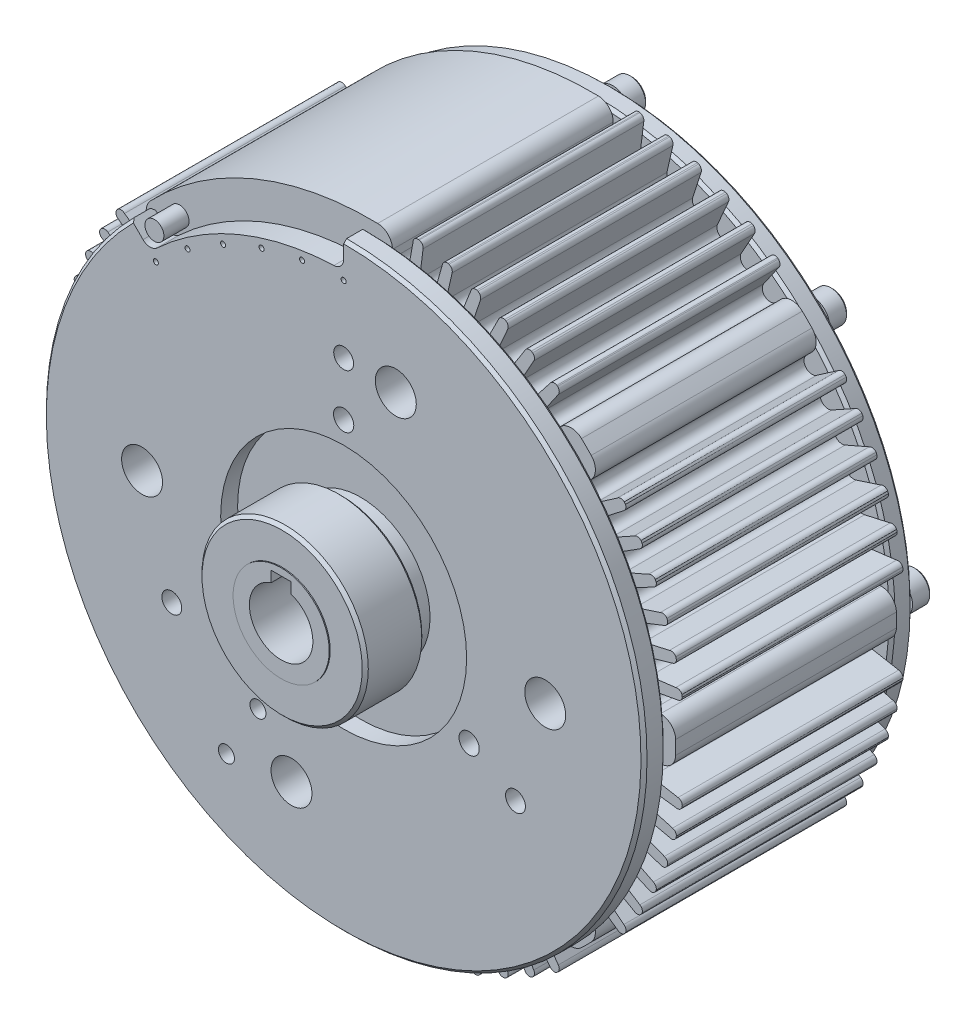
from build123d import *

# Parameters (mm, degrees)
SKETCH2_W                                 = 5.0038
SKETCH2_H                                 = 6.5034
CUT_EXTRUDE1_DEPTH                        = 154.466560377
F_1_4_20_TAPPED_HOLE1_AT_2_COUNT          = 2
F_1_4_20_TAPPED_HOLE1_AT_2_PITCH          = 63.241505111
F_1_4_20_TAPPED_HOLE1_AT_3_COUNT          = 2
F_1_4_20_TAPPED_HOLE1_AT_3_PITCH          = 63.241505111
M6X1_0_TAPPED_HOLE1_AT_2_COUNT            = 2
M6X1_0_TAPPED_HOLE1_AT_2_PITCH            = 86.602367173
M6X1_0_TAPPED_HOLE1_AT_3_COUNT            = 2
M6X1_0_TAPPED_HOLE1_AT_3_PITCH            = 86.602367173
F_13_32_0_40625_DIAMETER_HOLE1_D          = 10.31875
F_13_32_0_40625_DIAMETER_HOLE1_DEPTH      = 9.652
F_13_32_0_40625_DIAMETER_HOLE1_TIP        = 3.100065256
CIRPATTERN1_COUNT                         = 8
F_13_32_0_40625_DIAMETER_HOLE2_AT_2_COUNT = 2
F_13_32_0_40625_DIAMETER_HOLE2_AT_2_PITCH = 80.604699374
CIRPATTERN2_COUNT                         = 2
F_10_32_TAPPED_HOLE1_D                    = 4.0386
F_10_32_TAPPED_HOLE1_DEPTH                = 11.938
F_10_32_TAPPED_HOLE1_TIP                  = 1.213317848
SKETCH14_OUTSIDE_W                        = 210.29
SKETCH14_OUTSIDE_H                        = 210.29
CUT_EXTRUDE2_DEPTH                        = 55.626
CUT_EXTRUDE6_REACH                        = 144.198
SKETCH17_R                                = 0.635
SKETCH18_R                                = 2.3876
BOSS_EXTRUDE1_DEPTH                       = 6.35


with BuildPart() as part:
    # Sketch1 → Revolve1 (revolve)
    with BuildSketch(Plane(origin=(0, 0, 0), x_dir=(0, 0, -1), z_dir=(1, 0, 0)), mode=Mode.PRIVATE) as revolve1_sk:
        with BuildLine():
            Line((-15.754206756, 8), (-15.754206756, 12.108983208))
            Line((-15.754206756, 12.108983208), (-15.506, 12.108983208))
            Line((-15.506, 12.108983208), (-15.506, 20.193))
            Line((-15.506, 20.193), (-14.744, 20.955))
            Line((-14.744, 20.955), (-1.268, 20.955))
            Line((-1.268, 20.955), (-0.506, 20.193))
            Line((-0.506, 20.193), (-0.506, 17.505))
            Line((-0.506, 17.505), (4.2672, 17.505))
            Line((4.2672, 17.505), (4.2672, 30.99181))
            Line((4.2672, 30.99181), (0, 30.99181))
            Line((0, 30.99181), (0, 74.93))
            Line((0, 74.93), (0.762, 75.692))
            Line((0.762, 75.692), (4.826, 75.692))
            Line((4.826, 75.692), (5.588, 74.93))
            Line((5.588, 74.93), (5.588, 66.6115))
            Line((5.588, 66.6115), (6.848, 66.6115))
            Line((6.848, 66.6115), (6.848, 79.375))
            Line((6.848, 79.375), (62.474, 79.375))
            Line((62.474, 79.375), (62.474, 74.93))
            Line((62.474, 74.93), (63.236, 75.692))
            Line((63.236, 75.692), (67.046, 75.692))
            Line((67.046, 75.692), (67.808, 74.93))
            Line((67.808, 74.93), (67.808, 66.548))
            Line((67.808, 66.548), (71.872, 66.548))
            Line((71.872, 66.548), (72.634, 65.786))
            Line((72.634, 65.786), (72.634, 31.0007))
            Line((72.634, 31.0007), (75.652045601, 31.0007))
            Line((75.652045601, 31.0007), (76.463693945, 30.189051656))
            Line((76.463693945, 30.189051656), (76.463693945, 19.347690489))
            ThreePointArc((76.463693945, 19.347690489), (76.639104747, 19.863331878), (76.965370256, 20.299457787))
            Line((76.965370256, 20.299457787), (80.894994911, 24.114894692))
            Line((80.894994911, 24.114894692), (81.864862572, 23.173209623))
            Line((81.864862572, 23.173209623), (81.607463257, 22.098))
            Line((81.607463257, 22.098), (86.866125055, 22.098))
            ThreePointArc((86.866125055, 22.098), (87.93786431, 21.654071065), (88.381793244, 20.582331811))
            Line((88.381793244, 20.582331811), (88.381793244, 14.867163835))
            Line((88.381793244, 14.867163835), (88.893793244, 13.978425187))
            Line((88.893793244, 13.978425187), (88.893793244, 8))
            Line((88.893793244, 8), (-15.754206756, 8))
        make_face()
    revolve(revolve1_sk.sketch.rotate(Axis((0, 0, 38.095236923), (0, 0, -1)), 90), axis=Axis((0, 0, 38.095236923), (0, 0, -1)))

    # Sketch2 → Cut-Extrude1 (cut, through all)
    with BuildSketch(Plane(origin=(0, 0, -88.893793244), x_dir=(-1, 0, 0), z_dir=(0, 0, -1))):
        with Locations((0, 7.0617)):
            Rectangle(SKETCH2_W, SKETCH2_H)
    extrude(amount=-CUT_EXTRUDE1_DEPTH, mode=Mode.SUBTRACT)

    # Sketch3 → 1_4-20 Tapped Hole1 (revolve, cut)
    with BuildSketch(Plane(origin=(-31.620752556, -18.25625, -72.634), x_dir=(0, 1, 0), z_dir=(1, 0, 0))):
        Polygon((0, 0), (0, 12.709816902), (2.5527, 11.176), (2.5527, 0), align=None)
    f_1_4_20_tapped_hole1 = revolve(axis=Axis((-31.620752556, -18.25625, -78.984), (0, 0, 1)), mode=Mode.SUBTRACT)

    # 1_4-20 Tapped Hole1 at 2: 1_4-20 Tapped Hole1 ×2
    with Locations(*[(i * F_1_4_20_TAPPED_HOLE1_AT_2_PITCH, 0, 0) for i in range(1, F_1_4_20_TAPPED_HOLE1_AT_2_COUNT)]):
        add(f_1_4_20_tapped_hole1, mode=Mode.SUBTRACT)

    # 1_4-20 Tapped Hole1 at 3: 1_4-20 Tapped Hole1 ×2
    with Locations(*[Vector(0.49999999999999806, 0.8660254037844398, 0) * (i * F_1_4_20_TAPPED_HOLE1_AT_3_PITCH) for i in range(1, F_1_4_20_TAPPED_HOLE1_AT_3_COUNT)]):
        add(f_1_4_20_tapped_hole1, mode=Mode.SUBTRACT)

    # Sketch5 → M6x1.0 Tapped Hole1 (revolve, cut)
    with BuildSketch(Plane(origin=(0, 49.9999, -72.634), x_dir=(0, 1, 0), z_dir=(1, 0, 0))):
        Polygon((0, 0), (0, 16.488151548), (2.5, 14.986), (2.5, 0), align=None)
    m6x1_0_tapped_hole1 = revolve(axis=Axis((0, 49.9999, -78.984), (0, 0, 1)), mode=Mode.SUBTRACT)

    # M6x1.0 Tapped Hole1 at 2: M6x1.0 Tapped Hole1 ×2
    with Locations(*[Vector(0.49999999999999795, -0.8660254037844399, 0) * (i * M6X1_0_TAPPED_HOLE1_AT_2_PITCH) for i in range(1, M6X1_0_TAPPED_HOLE1_AT_2_COUNT)]):
        add(m6x1_0_tapped_hole1, mode=Mode.SUBTRACT)

    # M6x1.0 Tapped Hole1 at 3: M6x1.0 Tapped Hole1 ×2
    with Locations(*[Vector(-0.49999999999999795, -0.8660254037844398, 0) * (i * M6X1_0_TAPPED_HOLE1_AT_3_PITCH) for i in range(1, M6X1_0_TAPPED_HOLE1_AT_3_COUNT)]):
        add(m6x1_0_tapped_hole1, mode=Mode.SUBTRACT)

    # 13_32 _0.40625_ Diameter Hole1
    with Locations(Plane(origin=(0, 0, -72.634), x_dir=(-1, 0, 0), z_dir=(0, 0, -1))):
        with Locations((50.8, 0), (-50.8, 0)):
            Hole(F_13_32_0_40625_DIAMETER_HOLE1_D / 2, depth=F_13_32_0_40625_DIAMETER_HOLE1_DEPTH)
            with Locations((0, 0, -(F_13_32_0_40625_DIAMETER_HOLE1_DEPTH + F_13_32_0_40625_DIAMETER_HOLE1_TIP / 2))):  # 118° drill point
                Cone(0, F_13_32_0_40625_DIAMETER_HOLE1_D / 2, F_13_32_0_40625_DIAMETER_HOLE1_TIP, mode=Mode.SUBTRACT)

    # Sketch9 → Revolve2 (revolve)
    with BuildSketch(Plane(origin=(0, 0, 0), x_dir=(0, 0, -1), z_dir=(1, 0, 0)), mode=Mode.PRIVATE) as revolve2_sk:
        Polygon((67.808, 75.55865), (72.126, 75.55865), (72.634, 75.05065), (72.634, 71.5899), (67.808, 71.5899), align=None)
    revolve2 = revolve(revolve2_sk.sketch.rotate(Axis((0, 71.5899, -41.060125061), (0, 0, -1)), 90), axis=Axis((0, 71.5899, -41.060125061), (0, 0, -1)))

    # CirPattern1: Revolve2 ×8 about axis
    cirpattern1_axis = Axis((0, 0, 0), (0, 0, 1))
    for i in range(1, CIRPATTERN1_COUNT):
        add(revolve2.rotate(cirpattern1_axis, i * 360 / CIRPATTERN1_COUNT))

    # Mirror1: 1_4-20 Tapped Hole1, M6x1.0 Tapped Hole1 across plane
    add(f_1_4_20_tapped_hole1.mirror(Plane(origin=(0, 0, -36.317), x_dir=(1, 0, 0), z_dir=(0, 0, -1))), mode=Mode.SUBTRACT)
    add(m6x1_0_tapped_hole1.mirror(Plane(origin=(0, 0, -36.317), x_dir=(1, 0, 0), z_dir=(0, 0, -1))), mode=Mode.SUBTRACT)

    # Mirror1 copy 1 sketch → Mirror1 copy 1 (revolve, cut)
    with BuildSketch(Plane(origin=(31.620752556, -18.25625, 0), x_dir=(0, 1, 0), z_dir=(1, 0, 0))):
        Polygon((0, 0), (0, -12.709816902), (2.5527, -11.176), (2.5527, 0), align=None)
    revolve(axis=Axis((31.620752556, -18.25625, 6.35), (0, 0, 1)), mode=Mode.SUBTRACT)

    # Mirror1 copy 2 sketch → Mirror1 copy 2 (revolve, cut)
    with BuildSketch(Plane(origin=(0, 36.5125, 0), x_dir=(0, 1, 0), z_dir=(1, 0, 0))):
        Polygon((0, 0), (0, -12.709816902), (2.5527, -11.176), (2.5527, 0), align=None)
    revolve(axis=Axis((0, 36.5125, 6.35), (0, 0, 1)), mode=Mode.SUBTRACT)

    # Mirror1 copy 3 sketch → Mirror1 copy 3 (revolve, cut)
    with BuildSketch(Plane(origin=(43.301183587, -24.99995, 0), x_dir=(0, 1, 0), z_dir=(1, 0, 0))):
        Polygon((0, 0), (0, -16.488151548), (2.5, -14.986), (2.5, 0), align=None)
    revolve(axis=Axis((43.301183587, -24.99995, 6.35), (0, 0, 1)), mode=Mode.SUBTRACT)

    # Mirror1 copy 4 sketch → Mirror1 copy 4 (revolve, cut)
    with BuildSketch(Plane(origin=(-43.301183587, -24.99995, 0), x_dir=(0, 1, 0), z_dir=(1, 0, 0))):
        Polygon((0, 0), (0, -16.488151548), (2.5, -14.986), (2.5, 0), align=None)
    revolve(axis=Axis((-43.301183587, -24.99995, 6.35), (0, 0, 1)), mode=Mode.SUBTRACT)

    # Sketch10 → 13_32 _0.40625_ Diameter Hole2 (revolve, cut)
    with BuildSketch(Plane(origin=(-50.8, 0, 0), x_dir=(0, -1, 0), z_dir=(1, 0, 0))):
        Polygon((0, 0), (0, 12.752065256), (5.159375, 9.652), (5.159375, 0), align=None)
    f_13_32_0_40625_diameter_hole2 = revolve(axis=Axis((-50.8, 0, 6.35), (0, 0, -1)), mode=Mode.SUBTRACT)

    # 13_32 _0.40625_ Diameter Hole2 at 2: 13_32 _0.40625_ Diameter Hole2 ×2
    with Locations(*[Vector(0.7933533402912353, 0.6087614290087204, 0) * (i * F_13_32_0_40625_DIAMETER_HOLE2_AT_2_PITCH) for i in range(1, F_13_32_0_40625_DIAMETER_HOLE2_AT_2_COUNT)]):
        add(f_13_32_0_40625_diameter_hole2, mode=Mode.SUBTRACT)

    # CirPattern2: 13_32 _0.40625_ Diameter Hole2 ×2 about axis
    cirpattern2_axis = Axis((0, 0, 0), (0, 0, 1))
    for i in range(1, CIRPATTERN2_COUNT):
        add(f_13_32_0_40625_diameter_hole2.rotate(cirpattern2_axis, i * 360 / CIRPATTERN2_COUNT), mode=Mode.SUBTRACT)

    # CirPattern2 copy 1 sketch → CirPattern2 copy 1 (revolve, cut)
    with BuildSketch(Plane(origin=(-13.148007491, -49.069031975, 0), x_dir=(0, 1, 0), z_dir=(-1, 0, 0))):
        Polygon((0, 0), (0, 12.752065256), (5.159375, 9.652), (5.159375, 0), align=None)
    revolve(axis=Axis((-13.148007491, -49.069031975, 6.35), (0, 0, -1)), mode=Mode.SUBTRACT)

    # 10-32 Tapped Hole1
    with Locations(Plane.XY):
        with Locations((-21.59, -37.3888), (-29.5402, -51.1556)):
            Hole(F_10_32_TAPPED_HOLE1_D / 2, depth=F_10_32_TAPPED_HOLE1_DEPTH)
            with Locations((0, 0, -(F_10_32_TAPPED_HOLE1_DEPTH + F_10_32_TAPPED_HOLE1_TIP / 2))):  # 118° drill point
                Cone(0, F_10_32_TAPPED_HOLE1_D / 2, F_10_32_TAPPED_HOLE1_TIP, mode=Mode.SUBTRACT)

    # Sketch14 outside → Cut-Extrude2 (cut)
    with BuildSketch(Plane.XY.offset(-6.848)):
        Rectangle(SKETCH14_OUTSIDE_W, SKETCH14_OUTSIDE_H)
        with BuildLine():
            Line((10.64243444, 77.196331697), (9.453260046, 70.715791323))
            ThreePointArc((9.453260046, 70.715791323), (7.275354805, 68.9015165), (5.461079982, 71.07942174))
            Line((5.461079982, 71.07942174), (5.461079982, 73.009870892))
            ThreePointArc((5.461079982, 73.009870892), (4.375441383, 75.673318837), (1.737219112, 76.818897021))
            ThreePointArc((1.737219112, 76.818897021), (0.868665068, 76.833627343), (0, 76.83853766))
            ThreePointArc((0, 76.83853766), (-30.202937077, 70.653686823), (-55.543713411, 53.094790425))
            ThreePointArc((-55.543713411, 53.094790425), (-56.598420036, 50.418010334), (-55.478838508, 47.767709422))
            Line((-55.478838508, 47.767709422), (-53.924633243, 46.185729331))
            ThreePointArc((-53.924633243, 46.185729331), (-54.082997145, 43.616948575), (-56.644481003, 43.366920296))
            Line((-56.644481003, 43.366920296), (-62.058491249, 47.082630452))
            ThreePointArc((-62.058491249, 47.082630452), (-63.920430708, 47.011508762), (-63.707480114, 45.160420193))
            Line((-63.707480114, 45.160420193), (-58.150806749, 40.835928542))
            ThreePointArc((-58.150806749, 40.835928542), (-57.970497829, 38.240802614), (-60.51575317, 37.703340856))
            Line((-60.51575317, 37.703340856), (-66.285279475, 40.914874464))
            ThreePointArc((-66.285279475, 40.914874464), (-68.131830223, 40.665621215), (-67.742441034, 38.8434651))
            Line((-67.742441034, 38.8434651), (-61.796865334, 35.071466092))
            ThreePointArc((-61.796865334, 35.071466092), (-61.368654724, 32.505569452), (-63.850678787, 31.726630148))
            Line((-63.850678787, 31.726630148), (-69.901455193, 34.370393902))
            ThreePointArc((-69.901455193, 34.370393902), (-71.715614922, 33.945304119), (-71.15337248, 32.16885815))
            Line((-71.15337248, 32.16885815), (-64.873638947, 28.984082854))
            ThreePointArc((-64.873638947, 28.984082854), (-64.201469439, 26.471041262), (-66.597408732, 25.457796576))
            Line((-66.597408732, 25.457796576), (-72.873722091, 27.509447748))
            ThreePointArc((-72.873722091, 27.509447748), (-74.638786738, 26.91243549), (-73.908867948, 25.198056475))
            Line((-73.908867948, 25.198056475), (-67.352797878, 22.629829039))
            ThreePointArc((-67.352797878, 22.629829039), (-66.442858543, 20.192781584), (-68.730652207, 18.954561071))
            Line((-68.730652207, 18.954561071), (-75.174712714, 20.395208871))
            ThreePointArc((-75.174712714, 20.395208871), (-76.874430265, 19.631771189), (-75.983555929, 17.995244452))
            Line((-75.983555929, 17.995244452), (-69.211515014, 16.067212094))
            ThreePointArc((-69.211515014, 16.067212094), (-68.072184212, 13.728598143), (-70.230767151, 12.276802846))
            Line((-70.230767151, 12.276802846), (-76.783240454, 13.093182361))
            ThreePointArc((-76.783240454, 13.093182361), (-78.401960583, 12.170348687), (-77.35833352, 10.626742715))
            Line((-77.35833352, 10.626742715), (-70.690488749, 9.417234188))
            ThreePointArc((-70.690488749, 9.417234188), (-69.07368089, 7.268394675), (-71.062054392, 5.457883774))
            Line((-71.062054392, 5.457883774), (-73.013132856, 5.457883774))
            ThreePointArc((-73.013132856, 5.457883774), (-75.674300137, 4.37317471), (-76.818897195, 1.73721139))
            ThreePointArc((-76.818897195, 1.73721139), (-76.833627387, 0.868661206), (-76.83853766, 0))
            ThreePointArc((-76.83853766, 0), (-76.833627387, -0.868661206), (-76.818897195, -1.73721139))
            ThreePointArc((-76.818897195, -1.73721139), (-75.674300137, -4.37317471), (-73.013132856, -5.457883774))
            Line((-73.013132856, -5.457883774), (-71.062054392, -5.457883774))
            ThreePointArc((-71.062054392, -5.457883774), (-69.039267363, -7.268374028), (-70.690488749, -9.423138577))
            Line((-70.690488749, -9.423138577), (-77.358333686, -10.626023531))
            ThreePointArc((-77.358333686, -10.626023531), (-78.401960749, -12.169629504), (-76.78324062, -13.092463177))
            Line((-76.78324062, -13.092463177), (-70.230767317, -12.276083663))
            ThreePointArc((-70.230767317, -12.276083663), (-68.072184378, -13.72787896), (-69.21151518, -16.066492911))
            Line((-69.21151518, -16.066492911), (-75.983556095, -17.994525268))
            ThreePointArc((-75.983556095, -17.994525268), (-76.874430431, -19.631052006), (-75.17471288, -20.394489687))
            Line((-75.17471288, -20.394489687), (-68.730652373, -18.953841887))
            ThreePointArc((-68.730652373, -18.953841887), (-66.442858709, -20.192062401), (-67.352798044, -22.629109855))
            Line((-67.352798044, -22.629109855), (-73.908868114, -25.197337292))
            ThreePointArc((-73.908868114, -25.197337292), (-74.638786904, -26.911716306), (-72.873722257, -27.508728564))
            Line((-72.873722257, -27.508728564), (-66.597408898, -25.457077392))
            ThreePointArc((-66.597408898, -25.457077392), (-64.201469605, -26.470322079), (-64.873639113, -28.98336367))
            Line((-64.873639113, -28.98336367), (-71.153372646, -32.168138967))
            ThreePointArc((-71.153372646, -32.168138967), (-71.715615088, -33.944584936), (-69.901455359, -34.369674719))
            Line((-69.901455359, -34.369674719), (-63.850678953, -31.725910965))
            ThreePointArc((-63.850678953, -31.725910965), (-61.36865489, -32.504850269), (-61.7968655, -35.070746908))
            Line((-61.7968655, -35.070746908), (-67.7424412, -38.842745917))
            ThreePointArc((-67.7424412, -38.842745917), (-68.131830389, -40.664902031), (-66.285279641, -40.91415528))
            Line((-66.285279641, -40.91415528), (-60.515753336, -37.702621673))
            ThreePointArc((-60.515753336, -37.702621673), (-57.970497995, -38.240083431), (-58.150806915, -40.835209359))
            Line((-58.150806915, -40.835209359), (-63.70748028, -45.159701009))
            ThreePointArc((-63.70748028, -45.159701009), (-63.920430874, -47.010789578), (-62.058491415, -47.081911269))
            Line((-62.058491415, -47.081911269), (-56.644481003, -43.331059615))
            ThreePointArc((-56.644481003, -43.331059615), (-53.976055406, -43.696516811), (-54.0982095, -46.387080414))
            Line((-54.0982095, -46.387080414), (-55.478838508, -47.767709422))
            ThreePointArc((-55.478838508, -47.767709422), (-56.598420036, -50.418010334), (-55.543713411, -53.094790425))
            ThreePointArc((-55.543713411, -53.094790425), (-54.33372791, -54.332374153), (-53.096174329, -55.54239049))
            ThreePointArc((-53.096174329, -55.54239049), (-50.431208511, -56.597828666), (-47.785022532, -55.496151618))
            Line((-47.785022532, -55.496151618), (-46.417914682, -54.129043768))
            ThreePointArc((-46.417914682, -54.129043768), (-43.675735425, -53.975368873), (-43.296849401, -56.695591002))
            Line((-43.296849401, -56.695591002), (-47.176474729, -62.253165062))
            ThreePointArc((-47.176474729, -62.253165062), (-46.822936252, -64.082615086), (-45.025786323, -63.590549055))
            Line((-45.025786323, -63.590549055), (-40.970860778, -58.36285486))
            ThreePointArc((-40.970860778, -58.36285486), (-38.417937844, -57.863080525), (-37.569916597, -60.322358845))
            Line((-37.569916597, -60.322358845), (-40.909667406, -66.47423892))
            ThreePointArc((-40.909667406, -66.47423892), (-40.468158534, -68.179518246), (-38.804941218, -67.599332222))
            Line((-38.804941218, -67.599332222), (-35.266994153, -62.02400151))
            ThreePointArc((-35.266994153, -62.02400151), (-32.695576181, -61.208288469), (-31.545421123, -63.648518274))
            Line((-31.545421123, -63.648518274), (-34.365251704, -70.10037093))
            ThreePointArc((-34.365251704, -70.10037093), (-33.739010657, -71.761338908), (-32.13413357, -71.002812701))
            Line((-32.13413357, -71.002812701), (-29.146846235, -65.114052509))
            ThreePointArc((-29.146846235, -65.114052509), (-26.671056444, -64.074298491), (-25.309248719, -66.388624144))
            Line((-25.309248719, -66.388624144), (-27.497714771, -73.081042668))
            ThreePointArc((-27.497714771, -73.081042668), (-26.698963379, -74.676495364), (-25.172611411, -73.752524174))
            Line((-25.172611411, -73.752524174), (-22.666715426, -67.357592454))
            ThreePointArc((-22.666715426, -67.357592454), (-20.360866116, -66.153329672), (-18.849293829, -68.270483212))
            Line((-18.849293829, -68.270483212), (-20.425888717, -75.388809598))
            ThreePointArc((-20.425888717, -75.388809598), (-19.412769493, -76.952608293), (-17.93081226, -75.823148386))
            Line((-17.93081226, -75.823148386), (-16.122036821, -69.472580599))
            ThreePointArc((-16.122036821, -69.472580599), (-13.942226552, -68.052856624), (-12.234693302, -70.015385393))
            Line((-12.234693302, -70.015385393), (-13.105978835, -77.002423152))
            ThreePointArc((-13.105978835, -77.002423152), (-11.947640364, -78.461919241), (-10.580759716, -77.195619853))
            Line((-10.580759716, -77.195619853), (-9.391585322, -70.715079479))
            ThreePointArc((-9.391585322, -70.715079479), (-7.270029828, -69.211872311), (-5.460917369, -71.079421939))
            Line((-5.460917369, -71.079421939), (-5.460917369, -73.009870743))
            ThreePointArc((-5.460917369, -73.009870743), (-4.375335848, -75.6732619), (-1.737219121, -76.81889702))
            ThreePointArc((-1.737219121, -76.81889702), (-0.868665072, -76.833627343), (0, -76.83853766))
            ThreePointArc((0, -76.83853766), (0.868665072, -76.833627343), (1.737219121, -76.81889702))
            ThreePointArc((1.737219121, -76.81889702), (4.377916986, -75.67079084), (5.461079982, -73.002797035))
            Line((5.461079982, -73.002797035), (5.461079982, -71.079421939))
            ThreePointArc((5.461079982, -71.079421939), (7.274998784, -68.901160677), (9.453260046, -70.715079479))
            Line((9.453260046, -70.715079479), (10.64243444, -77.195619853))
            ThreePointArc((10.64243444, -77.195619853), (12.009315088, -78.461919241), (13.167653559, -77.002423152))
            Line((13.167653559, -77.002423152), (12.296369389, -70.015385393))
            ThreePointArc((12.296369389, -70.015385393), (14.003902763, -68.052856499), (16.183713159, -69.472580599))
            Line((16.183713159, -69.472580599), (17.992487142, -75.823148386))
            ThreePointArc((17.992487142, -75.823148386), (19.47444436, -76.952608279), (20.487563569, -75.388809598))
            Line((20.487563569, -75.388809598), (18.990249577, -68.270483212))
            ThreePointArc((18.990249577, -68.270483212), (20.501821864, -66.153329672), (22.807671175, -67.357592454))
            Line((22.807671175, -67.357592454), (25.177156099, -73.752524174))
            ThreePointArc((25.177156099, -73.752524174), (26.760544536, -74.734744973), (27.619116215, -73.081042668))
            Line((27.619116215, -73.081042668), (25.430650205, -66.388624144))
            ThreePointArc((25.430650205, -66.388624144), (26.732343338, -64.136339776), (29.143000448, -65.114052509))
            Line((29.143000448, -65.114052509), (32.130287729, -71.002812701))
            ThreePointArc((32.130287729, -71.002812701), (33.800528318, -71.82875047), (34.496646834, -70.10037093))
            Line((34.496646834, -70.10037093), (31.676816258, -63.648518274))
            ThreePointArc((31.676816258, -63.648518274), (32.756644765, -61.281841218), (35.2499133, -62.02400151))
            Line((35.2499133, -62.02400151), (38.787860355, -67.599332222))
            ThreePointArc((38.787860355, -67.599332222), (40.529574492, -68.261381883), (41.056829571, -66.47423892))
            Line((41.056829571, -66.47423892), (37.631596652, -60.322358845))
            ThreePointArc((37.631596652, -60.322358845), (38.479617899, -57.863080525), (41.032540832, -58.36285486))
            Line((41.032540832, -58.36285486), (45.089676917, -63.590549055))
            ThreePointArc((45.089676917, -63.590549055), (46.886826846, -64.082615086), (47.240365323, -62.253165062))
            Line((47.240365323, -62.253165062), (43.376063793, -56.695591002))
            ThreePointArc((43.376063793, -56.695591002), (43.717872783, -54.014838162), (46.417914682, -54.129043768))
            Line((46.417914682, -54.129043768), (47.785022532, -55.496151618))
            ThreePointArc((47.785022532, -55.496151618), (50.431208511, -56.597828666), (53.096174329, -55.54239049))
            ThreePointArc((53.096174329, -55.54239049), (54.33372791, -54.332374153), (55.543713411, -53.094790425))
            ThreePointArc((55.543713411, -53.094790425), (56.598420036, -50.418010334), (55.478838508, -47.767709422))
            Line((55.478838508, -47.767709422), (54.0982095, -46.387080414))
            ThreePointArc((54.0982095, -46.387080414), (54.019588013, -43.648559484), (56.740777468, -43.331059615))
            Line((56.740777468, -43.331059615), (62.120167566, -47.081909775))
            ThreePointArc((62.120167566, -47.081909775), (63.982107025, -47.010788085), (63.769156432, -45.159699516))
            Line((63.769156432, -45.159699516), (58.212483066, -40.835207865))
            ThreePointArc((58.212483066, -40.835207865), (58.032174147, -38.240081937), (60.577429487, -37.702620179))
            Line((60.577429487, -37.702620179), (66.346955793, -40.914153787))
            ThreePointArc((66.346955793, -40.914153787), (68.19350654, -40.664900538), (67.804117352, -38.842744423))
            Line((67.804117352, -38.842744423), (61.858541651, -35.070745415))
            ThreePointArc((61.858541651, -35.070745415), (61.430331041, -32.504848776), (63.912355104, -31.725909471))
            Line((63.912355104, -31.725909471), (69.96313151, -34.369673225))
            ThreePointArc((69.96313151, -34.369673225), (71.777291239, -33.944583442), (71.215048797, -32.168137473))
            Line((71.215048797, -32.168137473), (64.935315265, -28.983362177))
            ThreePointArc((64.935315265, -28.983362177), (64.263145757, -26.470320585), (66.65908505, -25.457075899))
            Line((66.65908505, -25.457075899), (72.935398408, -27.508727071))
            ThreePointArc((72.935398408, -27.508727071), (74.700463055, -26.911714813), (73.970544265, -25.197335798))
            Line((73.970544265, -25.197335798), (67.414474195, -22.629108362))
            ThreePointArc((67.414474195, -22.629108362), (66.50453486, -20.192060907), (68.792328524, -18.953840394))
            Line((68.792328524, -18.953840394), (75.236389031, -20.394488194))
            ThreePointArc((75.236389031, -20.394488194), (76.936106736, -19.631050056), (76.045231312, -17.994523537))
            Line((76.045231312, -17.994523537), (69.273189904, -16.066492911))
            ThreePointArc((69.273189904, -16.066492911), (68.133859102, -13.72787896), (70.292442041, -12.276083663))
            Line((70.292442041, -12.276083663), (76.844915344, -13.092463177))
            ThreePointArc((76.844915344, -13.092463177), (78.463635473, -12.169629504), (77.42000841, -10.626023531))
            Line((77.42000841, -10.626023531), (70.715529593, -9.423138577))
            ThreePointArc((70.715529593, -9.423138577), (69.083273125, -7.280312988), (71.069809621, -5.461072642))
            Line((71.069809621, -5.461072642), (73.009871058, -5.461072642))
            ThreePointArc((73.009871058, -5.461072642), (75.67331914, -4.37543391), (76.818897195, -1.73721139))
            ThreePointArc((76.818897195, -1.73721139), (76.833627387, -0.868661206), (76.83853766, 0))
            ThreePointArc((76.83853766, 0), (76.833627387, 0.868661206), (76.818897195, 1.73721139))
            ThreePointArc((76.818897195, 1.73721139), (75.672204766, 4.373363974), (73.009871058, 5.457883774))
            Line((73.009871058, 5.457883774), (71.069809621, 5.457883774))
            ThreePointArc((71.069809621, 5.457883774), (69.082225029, 7.27556161), (70.715529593, 9.417234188))
            Line((70.715529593, 9.417234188), (77.420008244, 10.626742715))
            ThreePointArc((77.420008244, 10.626742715), (78.463635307, 12.170348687), (76.844915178, 13.093182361))
            Line((76.844915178, 13.093182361), (70.292441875, 12.276802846))
            ThreePointArc((70.292441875, 12.276802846), (68.133858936, 13.728598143), (69.273189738, 16.067212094))
            Line((69.273189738, 16.067212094), (76.045233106, 17.995235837))
            ThreePointArc((76.045233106, 17.995235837), (76.93610644, 19.631762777), (75.236389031, 20.395200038))
            Line((75.236389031, 20.395200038), (68.792328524, 18.954552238))
            ThreePointArc((68.792328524, 18.954552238), (66.50453486, 20.192772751), (67.414474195, 22.629820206))
            Line((67.414474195, 22.629820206), (73.970544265, 25.198047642))
            ThreePointArc((73.970544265, 25.198047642), (74.700463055, 26.912426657), (72.935398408, 27.509438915))
            Line((72.935398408, 27.509438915), (66.65908505, 25.457787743))
            ThreePointArc((66.65908505, 25.457787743), (64.263145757, 26.471032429), (64.935315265, 28.984074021))
            Line((64.935315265, 28.984074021), (71.215048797, 32.168849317))
            ThreePointArc((71.215048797, 32.168849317), (71.777291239, 33.945295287), (69.96313151, 34.370385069))
            Line((69.96313151, 34.370385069), (63.912355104, 31.726621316))
            ThreePointArc((63.912355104, 31.726621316), (61.430331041, 32.50556062), (61.858541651, 35.071457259))
            Line((61.858541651, 35.071457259), (67.804117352, 38.843456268))
            ThreePointArc((67.804117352, 38.843456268), (68.19350654, 40.665612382), (66.346955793, 40.914865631))
            Line((66.346955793, 40.914865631), (60.577429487, 37.703332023))
            ThreePointArc((60.577429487, 37.703332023), (58.032174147, 38.240793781), (58.212483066, 40.83591971))
            Line((58.212483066, 40.83591971), (63.769156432, 45.16041136))
            ThreePointArc((63.769156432, 45.16041136), (63.982107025, 47.011499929), (62.120167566, 47.08262162))
            Line((62.120167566, 47.08262162), (56.740777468, 43.366920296))
            ThreePointArc((56.740777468, 43.366920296), (54.037449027, 43.667744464), (54.0982095, 46.387080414))
            Line((54.0982095, 46.387080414), (55.478838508, 47.767709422))
            ThreePointArc((55.478838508, 47.767709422), (56.598420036, 50.418010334), (55.543713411, 53.094790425))
            ThreePointArc((55.543713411, 53.094790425), (54.33372791, 54.332374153), (53.096174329, 55.54239049))
            ThreePointArc((53.096174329, 55.54239049), (50.431208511, 56.597828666), (47.785022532, 55.496151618))
            Line((47.785022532, 55.496151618), (46.417914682, 54.129043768))
            ThreePointArc((46.417914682, 54.129043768), (43.738509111, 53.996061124), (43.376063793, 56.654167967))
            Line((43.376063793, 56.654167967), (47.240365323, 62.219623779))
            ThreePointArc((47.240365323, 62.219623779), (46.886826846, 64.049073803), (45.089676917, 63.557007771))
            Line((45.089676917, 63.557007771), (41.032540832, 58.363570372))
            ThreePointArc((41.032540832, 58.363570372), (38.479617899, 57.863796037), (37.631596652, 60.323074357))
            Line((37.631596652, 60.323074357), (41.056829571, 66.474951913))
            ThreePointArc((41.056829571, 66.474951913), (40.529574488, 68.262094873), (38.787860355, 67.600045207))
            Line((38.787860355, 67.600045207), (35.2499133, 62.024714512))
            ThreePointArc((35.2499133, 62.024714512), (32.756644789, 61.282554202), (31.676816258, 63.649231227))
            Line((31.676816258, 63.649231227), (34.496646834, 70.101083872))
            ThreePointArc((34.496646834, 70.101083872), (33.800528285, 71.829463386), (32.130287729, 71.003525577))
            Line((32.130287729, 71.003525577), (29.143000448, 65.114765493))
            ThreePointArc((29.143000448, 65.114765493), (26.732343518, 64.137052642), (25.430650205, 66.389336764))
            Line((25.430650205, 66.389336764), (27.619116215, 73.081755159))
            ThreePointArc((27.619116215, 73.081755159), (26.76054428, 74.735457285), (25.177156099, 73.753236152))
            Line((25.177156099, 73.753236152), (22.807671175, 67.852234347))
            ThreePointArc((22.807671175, 67.852234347), (20.501831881, 66.647966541), (18.990249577, 68.765104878))
            Line((18.990249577, 68.765104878), (20.487563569, 75.389521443))
            ThreePointArc((20.487563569, 75.389521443), (19.47444436, 76.953320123), (17.992487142, 75.82386023))
            Line((17.992487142, 75.82386023), (16.183713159, 69.473290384))
            ThreePointArc((16.183713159, 69.473290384), (14.003902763, 68.053566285), (12.296369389, 70.016095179))
            Line((12.296369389, 70.016095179), (13.167653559, 77.003134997))
            ThreePointArc((13.167653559, 77.003134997), (12.009315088, 78.462631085), (10.64243444, 77.196331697))
        make_face(mode=Mode.SUBTRACT)
    extrude(amount=-CUT_EXTRUDE2_DEPTH, mode=Mode.SUBTRACT)

    # Cut-Extrude6: up to this face of the body (flat: up to its plane)
    cut_extrude6_end = Plane(part.part.faces().sort_by_distance((-72.810659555, 0, -5.588))[0])
    # Sketch17 → Cut-Extrude6 (cut, up to the picked face)
    with BuildSketch(Plane.XY, mode=Mode.PRIVATE) as cut_extrude6_sk1:
        with Locations((-47.325949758, 47.325949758)):
            Circle(SKETCH17_R)
    cut_extrude6_tool1 = split(extrude(cut_extrude6_sk1.sketch, amount=-CUT_EXTRUDE6_REACH, mode=Mode.PRIVATE), bisect_by=cut_extrude6_end, keep=Keep.BOTH, mode=Mode.PRIVATE)
    # Sketch17 → Cut-Extrude6 (cut, up to the picked face)
    with BuildSketch(Plane.XY, mode=Mode.PRIVATE) as cut_extrude6_sk2:
        with Locations((-39.339879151, 54.146698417)):
            Circle(SKETCH17_R)
    cut_extrude6_tool2 = split(extrude(cut_extrude6_sk2.sketch, amount=-CUT_EXTRUDE6_REACH, mode=Mode.PRIVATE), bisect_by=cut_extrude6_end, keep=Keep.BOTH, mode=Mode.PRIVATE)
    # Sketch17 → Cut-Extrude6 (cut, up to the picked face)
    with BuildSketch(Plane.XY, mode=Mode.PRIVATE) as cut_extrude6_sk3:
        with Locations((-30.385130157, 59.634175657)):
            Circle(SKETCH17_R)
    cut_extrude6_tool3 = split(extrude(cut_extrude6_sk3.sketch, amount=-CUT_EXTRUDE6_REACH, mode=Mode.PRIVATE), bisect_by=cut_extrude6_end, keep=Keep.BOTH, mode=Mode.PRIVATE)
    # Sketch17 → Cut-Extrude6 (cut, up to the picked face)
    with BuildSketch(Plane.XY, mode=Mode.PRIVATE) as cut_extrude6_sk4:
        with Locations((-20.682198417, 63.653261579)):
            Circle(SKETCH17_R)
    cut_extrude6_tool4 = split(extrude(cut_extrude6_sk4.sketch, amount=-CUT_EXTRUDE6_REACH, mode=Mode.PRIVATE), bisect_by=cut_extrude6_end, keep=Keep.BOTH, mode=Mode.PRIVATE)
    # Sketch17 → Cut-Extrude6 (cut, up to the picked face)
    with BuildSketch(Plane.XY, mode=Mode.PRIVATE) as cut_extrude6_sk5:
        with Locations((-10.470002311, 66.104992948)):
            Circle(SKETCH17_R)
    cut_extrude6_tool5 = split(extrude(cut_extrude6_sk5.sketch, amount=-CUT_EXTRUDE6_REACH, mode=Mode.PRIVATE), bisect_by=cut_extrude6_end, keep=Keep.BOTH, mode=Mode.PRIVATE)
    # Sketch17 → Cut-Extrude6 (cut, up to the picked face)
    with BuildSketch(Plane.XY, mode=Mode.PRIVATE) as cut_extrude6_sk6:
        with Locations((0, 66.929)):
            Circle(SKETCH17_R)
    cut_extrude6_tool6 = split(extrude(cut_extrude6_sk6.sketch, amount=-CUT_EXTRUDE6_REACH, mode=Mode.PRIVATE), bisect_by=cut_extrude6_end, keep=Keep.BOTH, mode=Mode.PRIVATE)
    # Sketch17 → Cut-Extrude6 (cut, up to the picked face)
    with BuildSketch(Plane.XY, mode=Mode.PRIVATE) as cut_extrude6_sk7:
        with BuildLine():
            Line((0, 71.506702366), (0, 82.16352584))
            Line((0, 82.16352584), (-65.291447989, 65.291447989))
            Line((-65.291447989, 65.291447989), (-50.562874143, 50.562874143))
            ThreePointArc((-50.562874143, 50.562874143), (-48.811913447, 49.819325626), (-47.035661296, 50.500248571))
            ThreePointArc((-47.035661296, 50.500248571), (-26.409672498, 63.758589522), (-2.449833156, 68.968303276))
            ThreePointArc((-2.449833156, 68.968303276), (-0.712347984, 69.742817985), (0, 71.506702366))
        make_face()
    cut_extrude6_tool7 = split(extrude(cut_extrude6_sk7.sketch, amount=-CUT_EXTRUDE6_REACH, mode=Mode.PRIVATE), bisect_by=cut_extrude6_end, keep=Keep.BOTH, mode=Mode.PRIVATE)
    add(cut_extrude6_tool1.solids().sort_by(Axis((-47.32595, 47.32595, 0), (0, 0, -1)))[0], mode=Mode.SUBTRACT)
    add(cut_extrude6_tool2.solids().sort_by(Axis((-39.339879, 54.146698, 0), (0, 0, -1)))[0], mode=Mode.SUBTRACT)
    add(cut_extrude6_tool3.solids().sort_by(Axis((-30.38513, 59.634176, 0), (0, 0, -1)))[0], mode=Mode.SUBTRACT)
    add(cut_extrude6_tool4.solids().sort_by(Axis((-20.682198, 63.653262, 0), (0, 0, -1)))[0], mode=Mode.SUBTRACT)
    add(cut_extrude6_tool5.solids().sort_by(Axis((-10.470002, 66.104993, 0), (0, 0, -1)))[0], mode=Mode.SUBTRACT)
    add(cut_extrude6_tool6.solids().sort_by(Axis((0, 66.929, 0), (0, 0, -1)))[0], mode=Mode.SUBTRACT)
    add(cut_extrude6_tool7.solids().sort_by(Axis((-32.398578, 66.979949, 0), (0, 0, -1)))[0], mode=Mode.SUBTRACT)

    # Sketch18 → Boss-Extrude1 (add)
    with BuildSketch(Plane.XY.offset(-6.848)):
        with Locations(Location((-48.183425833, 53.513115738, 0), (0, 0, 180))):
            Circle(SKETCH18_R)
    extrude(amount=BOSS_EXTRUDE1_DEPTH)


solid = part.part
